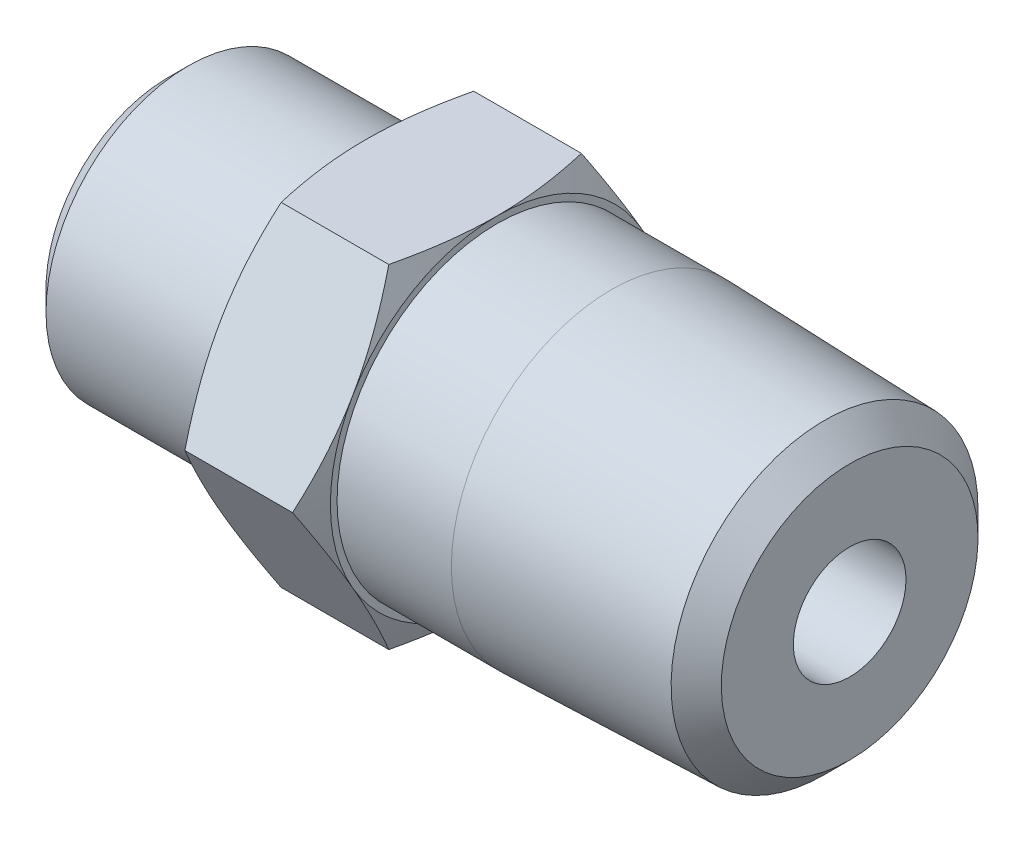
ISO-10303-21;
HEADER;
FILE_DESCRIPTION(('STEP AP214'),'2;1');
FILE_NAME('part.step','',(''),(''),'','','');
FILE_SCHEMA(('AUTOMOTIVE_DESIGN { 1 0 10303 214 1 1 1 1 }'));
ENDSEC;
DATA;
#1=APPLICATION_CONTEXT('core data for automotive mechanical design processes');
#2=APPLICATION_PROTOCOL_DEFINITION('international standard','automotive_design',2000,#1);
#3=PRODUCT_CONTEXT('',#1,'mechanical');
#4=PRODUCT('Part','Part','',(#3));
#5=PRODUCT_RELATED_PRODUCT_CATEGORY('part','',(#4));
#6=PRODUCT_DEFINITION_FORMATION('','',#4);
#7=PRODUCT_DEFINITION_CONTEXT('part definition',#1,'design');
#8=PRODUCT_DEFINITION('design','',#6,#7);
#9=PRODUCT_DEFINITION_SHAPE('','',#8);
#10=(LENGTH_UNIT() NAMED_UNIT(*) SI_UNIT(.MILLI.,.METRE.));
#11=(NAMED_UNIT(*) PLANE_ANGLE_UNIT() SI_UNIT($,.RADIAN.));
#12=(NAMED_UNIT(*) SI_UNIT($,.STERADIAN.) SOLID_ANGLE_UNIT());
#13=UNCERTAINTY_MEASURE_WITH_UNIT(LENGTH_MEASURE(1.E-05),#10,'distance_accuracy_value','');
#14=(GEOMETRIC_REPRESENTATION_CONTEXT(3) GLOBAL_UNCERTAINTY_ASSIGNED_CONTEXT((#13)) GLOBAL_UNIT_ASSIGNED_CONTEXT((#10,
#11,#12)) REPRESENTATION_CONTEXT('',''));
#15=CARTESIAN_POINT('',(0.,0.,0.));
#16=DIRECTION('',(0.,0.,1.));
#17=DIRECTION('',(1.,0.,0.));
#18=AXIS2_PLACEMENT_3D('',#15,#16,#17);
#19=CARTESIAN_POINT('',(0.876299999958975,0.,0.));
#20=DIRECTION('',(1.,0.,0.));
#21=DIRECTION('',(0.,0.,-1.));
#22=AXIS2_PLACEMENT_3D('',#19,#20,#21);
#23=CONICAL_SURFACE('',#22,6.0959999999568,0.785398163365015);
#24=CARTESIAN_POINT('',(0.8763,0.,0.));
#25=DIRECTION('',(1.,0.,0.));
#26=DIRECTION('',(0.,0.,-1.));
#27=AXIS2_PLACEMENT_3D('',#24,#25,#26);
#28=CIRCLE('',#27,6.096);
#29=CARTESIAN_POINT('',(0.876300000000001,0.,-6.096));
#30=VERTEX_POINT('',#29);
#31=EDGE_CURVE('E445',#30,#30,#28,.T.);
#32=ORIENTED_EDGE('',*,*,#31,.F.);
#33=EDGE_LOOP('',(#32));
#34=FACE_BOUND('',#33,.T.);
#35=CARTESIAN_POINT('',(-1.13686837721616E-10,0.,0.));
#36=DIRECTION('',(1.,0.,0.));
#37=DIRECTION('',(0.,0.,-1.));
#38=AXIS2_PLACEMENT_3D('',#35,#36,#37);
#39=CIRCLE('',#38,5.21969999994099);
#40=CARTESIAN_POINT('',(-1.13685955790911E-10,0.,-5.21969999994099));
#41=VERTEX_POINT('',#40);
#42=EDGE_CURVE('E20',#41,#41,#39,.F.);
#43=ORIENTED_EDGE('',*,*,#42,.F.);
#44=EDGE_LOOP('',(#43));
#45=FACE_BOUND('',#44,.T.);
#46=ADVANCED_FACE('F17',(#34,#45),#23,.T.);
#47=CARTESIAN_POINT('',(4.670298,0.,0.));
#48=DIRECTION('',(1.,0.,0.));
#49=DIRECTION('',(0.,0.,-1.));
#50=AXIS2_PLACEMENT_3D('',#47,#48,#49);
#51=CYLINDRICAL_SURFACE('',#50,6.096);
#52=CARTESIAN_POINT('',(8.464296,0.,0.));
#53=DIRECTION('',(1.,0.,0.));
#54=DIRECTION('',(0.,0.,-1.));
#55=AXIS2_PLACEMENT_3D('',#52,#53,#54);
#56=CIRCLE('',#55,6.096);
#57=CARTESIAN_POINT('',(8.464296,0.,-6.096));
#58=VERTEX_POINT('',#57);
#59=EDGE_CURVE('E516',#58,#58,#56,.T.);
#60=ORIENTED_EDGE('',*,*,#59,.F.);
#61=EDGE_LOOP('',(#60));
#62=FACE_BOUND('',#61,.T.);
#63=ORIENTED_EDGE('',*,*,#31,.T.);
#64=EDGE_LOOP('',(#63));
#65=FACE_BOUND('',#64,.T.);
#66=ADVANCED_FACE('F329',(#62,#65),#51,.T.);
#67=CARTESIAN_POINT('',(0.,0.,2.60985));
#68=DIRECTION('',(-1.,0.,0.));
#69=DIRECTION('',(0.,0.,1.));
#70=AXIS2_PLACEMENT_3D('',#67,#68,#69);
#71=PLANE('',#70);
#72=ORIENTED_EDGE('',*,*,#42,.T.);
#73=EDGE_LOOP('',(#72));
#74=FACE_BOUND('',#73,.T.);
#75=CARTESIAN_POINT('',(0.,0.,0.));
#76=DIRECTION('',(1.,0.,0.));
#77=DIRECTION('',(0.,0.,-1.));
#78=AXIS2_PLACEMENT_3D('',#75,#76,#77);
#79=CIRCLE('',#78,3.175);
#80=CARTESIAN_POINT('',(0.,0.,-3.175));
#81=VERTEX_POINT('',#80);
#82=EDGE_CURVE('E140',#81,#81,#79,.T.);
#83=ORIENTED_EDGE('',*,*,#82,.T.);
#84=EDGE_LOOP('',(#83));
#85=FACE_BOUND('',#84,.T.);
#86=ADVANCED_FACE('F327',(#74,#85),#71,.T.);
#87=CARTESIAN_POINT('',(8.464296,0.,3.571875));
#88=DIRECTION('',(-1.,0.,0.));
#89=DIRECTION('',(0.,0.,1.));
#90=AXIS2_PLACEMENT_3D('',#87,#88,#89);
#91=PLANE('',#90);
#92=CARTESIAN_POINT('',(8.464296,0.,0.));
#93=DIRECTION('',(1.,0.,0.));
#94=DIRECTION('',(0.,0.,-1.));
#95=AXIS2_PLACEMENT_3D('',#92,#93,#94);
#96=CIRCLE('',#95,7.14375);
#97=CARTESIAN_POINT('',(8.464296,-3.571875,6.18666897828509));
#98=VERTEX_POINT('',#97);
#99=CARTESIAN_POINT('',(8.464296,-7.14375,0.));
#100=VERTEX_POINT('',#99);
#101=EDGE_CURVE('E134',#98,#100,#96,.T.);
#102=ORIENTED_EDGE('',*,*,#101,.F.);
#103=CARTESIAN_POINT('',(8.464296,0.,0.));
#104=DIRECTION('',(1.,0.,0.));
#105=DIRECTION('',(0.,0.,-1.));
#106=AXIS2_PLACEMENT_3D('',#103,#104,#105);
#107=CIRCLE('',#106,7.14375);
#108=CARTESIAN_POINT('',(8.464296,3.57187500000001,6.18666897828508));
#109=VERTEX_POINT('',#108);
#110=EDGE_CURVE('E127',#109,#98,#107,.T.);
#111=ORIENTED_EDGE('',*,*,#110,.F.);
#112=CARTESIAN_POINT('',(8.464296,0.,0.));
#113=DIRECTION('',(1.,0.,0.));
#114=DIRECTION('',(0.,0.,-1.));
#115=AXIS2_PLACEMENT_3D('',#112,#113,#114);
#116=CIRCLE('',#115,7.14375);
#117=CARTESIAN_POINT('',(8.464296,7.14375,0.));
#118=VERTEX_POINT('',#117);
#119=EDGE_CURVE('E131',#118,#109,#116,.T.);
#120=ORIENTED_EDGE('',*,*,#119,.F.);
#121=CARTESIAN_POINT('',(8.464296,0.,0.));
#122=DIRECTION('',(1.,0.,0.));
#123=DIRECTION('',(0.,0.,-1.));
#124=AXIS2_PLACEMENT_3D('',#121,#122,#123);
#125=CIRCLE('',#124,7.14375);
#126=CARTESIAN_POINT('',(8.464296,3.571875,-6.18666897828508));
#127=VERTEX_POINT('',#126);
#128=EDGE_CURVE('E151',#127,#118,#125,.T.);
#129=ORIENTED_EDGE('',*,*,#128,.F.);
#130=CARTESIAN_POINT('',(8.464296,0.,0.));
#131=DIRECTION('',(1.,0.,0.));
#132=DIRECTION('',(0.,0.,-1.));
#133=AXIS2_PLACEMENT_3D('',#130,#131,#132);
#134=CIRCLE('',#133,7.14375);
#135=CARTESIAN_POINT('',(8.464296,-3.571875,-6.18666897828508));
#136=VERTEX_POINT('',#135);
#137=EDGE_CURVE('E152',#136,#127,#134,.T.);
#138=ORIENTED_EDGE('',*,*,#137,.F.);
#139=CARTESIAN_POINT('',(8.464296,0.,0.));
#140=DIRECTION('',(1.,0.,0.));
#141=DIRECTION('',(0.,0.,-1.));
#142=AXIS2_PLACEMENT_3D('',#139,#140,#141);
#143=CIRCLE('',#142,7.14375);
#144=EDGE_CURVE('E525',#100,#136,#143,.T.);
#145=ORIENTED_EDGE('',*,*,#144,.F.);
#146=EDGE_LOOP('',(#102,#111,#120,#129,#138,#145));
#147=FACE_BOUND('',#146,.T.);
#148=ORIENTED_EDGE('',*,*,#59,.T.);
#149=EDGE_LOOP('',(#148));
#150=FACE_BOUND('',#149,.T.);
#151=ADVANCED_FACE('F129',(#147,#150),#91,.T.);
#152=CARTESIAN_POINT('',(3.556,0.,0.));
#153=DIRECTION('',(1.,0.,0.));
#154=DIRECTION('',(0.,0.,-1.));
#155=AXIS2_PLACEMENT_3D('',#152,#153,#154);
#156=CYLINDRICAL_SURFACE('',#155,3.175);
#157=CARTESIAN_POINT('',(7.112,0.,0.));
#158=DIRECTION('',(1.,0.,0.));
#159=DIRECTION('',(0.,0.,-1.));
#160=AXIS2_PLACEMENT_3D('',#157,#158,#159);
#161=CIRCLE('',#160,3.175);
#162=CARTESIAN_POINT('',(7.112,0.,-3.175));
#163=VERTEX_POINT('',#162);
#164=EDGE_CURVE('E167',#163,#163,#161,.T.);
#165=ORIENTED_EDGE('',*,*,#164,.T.);
#166=EDGE_LOOP('',(#165));
#167=FACE_BOUND('',#166,.T.);
#168=ORIENTED_EDGE('',*,*,#82,.F.);
#169=EDGE_LOOP('',(#168));
#170=FACE_BOUND('',#169,.T.);
#171=ADVANCED_FACE('F320',(#167,#170),#156,.F.);
#172=CARTESIAN_POINT('',(8.98272418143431,0.,0.));
#173=DIRECTION('',(1.,0.,0.));
#174=DIRECTION('',(0.,0.,-1.));
#175=AXIS2_PLACEMENT_3D('',#172,#173,#174);
#176=CONICAL_SURFACE('',#175,8.25552282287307,1.13446401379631);
#177=ORIENTED_EDGE('',*,*,#110,.T.);
#178=CARTESIAN_POINT('',(8.97963216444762,0.,8.24889197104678));
#179=CARTESIAN_POINT('',(8.90070547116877,-0.293058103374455,8.07969479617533));
#180=CARTESIAN_POINT('',(8.82867608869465,-0.58769517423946,7.90958600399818));
#181=CARTESIAN_POINT('',(8.70188396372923,-1.17869518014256,7.56837199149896));
#182=CARTESIAN_POINT('',(8.64706399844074,-1.47504898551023,7.39727204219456));
#183=CARTESIAN_POINT('',(8.57993846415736,-1.92140845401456,7.13956628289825));
#184=CARTESIAN_POINT('',(8.5600754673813,-2.07056344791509,7.0534516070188));
#185=CARTESIAN_POINT('',(8.52573200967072,-2.36933901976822,6.88095345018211));
#186=CARTESIAN_POINT('',(8.51125147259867,-2.5189595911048,6.79456997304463));
#187=CARTESIAN_POINT('',(8.48791531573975,-2.81903318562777,6.6213224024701));
#188=CARTESIAN_POINT('',(8.47907862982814,-2.96948732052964,6.53445766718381));
#189=CARTESIAN_POINT('',(8.46725831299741,-3.27058454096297,6.36061910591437));
#190=CARTESIAN_POINT('',(8.46427535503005,-3.42122764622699,6.27364526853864));
#191=CARTESIAN_POINT('',(8.464296,-3.571875,6.18666897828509));
#192=B_SPLINE_CURVE_WITH_KNOTS('',3,(#178,#179,#180,#181,#182,#183,#184,#185,#186,#187,#188,
#189,#190,#191),.UNSPECIFIED.,.F.,.F.,(4,2,2,2,2,2,4),(0.,1.04269338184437,2.08188206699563,
2.60191814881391,3.12194687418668,3.6437111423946,4.1655353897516),.UNSPECIFIED.);
#193=CARTESIAN_POINT('',(8.97963216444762,0.,8.24889197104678));
#194=VERTEX_POINT('',#193);
#195=EDGE_CURVE('E157',#194,#98,#192,.T.);
#196=ORIENTED_EDGE('',*,*,#195,.F.);
#197=CARTESIAN_POINT('',(8.464296,3.57187500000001,6.18666897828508));
#198=CARTESIAN_POINT('',(8.46427535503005,3.421227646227,6.27364526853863));
#199=CARTESIAN_POINT('',(8.46725831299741,3.27058454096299,6.36061910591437));
#200=CARTESIAN_POINT('',(8.47907862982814,2.96948732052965,6.53445766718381));
#201=CARTESIAN_POINT('',(8.48791531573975,2.81903318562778,6.62132240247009));
#202=CARTESIAN_POINT('',(8.51125147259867,2.51895959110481,6.79456997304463));
#203=CARTESIAN_POINT('',(8.52573200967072,2.36933901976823,6.88095345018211));
#204=CARTESIAN_POINT('',(8.5600754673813,2.07056344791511,7.05345160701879));
#205=CARTESIAN_POINT('',(8.57993846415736,1.92140845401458,7.13956628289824));
#206=CARTESIAN_POINT('',(8.64706399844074,1.47504898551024,7.39727204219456));
#207=CARTESIAN_POINT('',(8.70188396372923,1.17869518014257,7.56837199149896));
#208=CARTESIAN_POINT('',(8.82867608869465,0.587695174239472,7.90958600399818));
#209=CARTESIAN_POINT('',(8.90070547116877,0.293058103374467,8.07969479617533));
#210=CARTESIAN_POINT('',(8.97963216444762,0.,8.24889197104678));
#211=B_SPLINE_CURVE_WITH_KNOTS('',3,(#197,#198,#199,#200,#201,#202,#203,#204,#205,#206,#207,
#208,#209,#210),.UNSPECIFIED.,.F.,.F.,(4,2,2,2,2,2,4),(0.,0.521824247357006,1.04358851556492,
1.56361724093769,2.08365332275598,3.12284200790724,4.16553538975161),.UNSPECIFIED.);
#212=EDGE_CURVE('E154',#109,#194,#211,.T.);
#213=ORIENTED_EDGE('',*,*,#212,.F.);
#214=EDGE_LOOP('',(#177,#196,#213));
#215=FACE_BOUND('',#214,.T.);
#216=ADVANCED_FACE('F155',(#215),#176,.T.);
#217=CARTESIAN_POINT('',(8.98272418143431,0.,0.));
#218=DIRECTION('',(1.,0.,0.));
#219=DIRECTION('',(0.,0.,-1.));
#220=AXIS2_PLACEMENT_3D('',#217,#218,#219);
#221=CONICAL_SURFACE('',#220,8.25552282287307,1.13446401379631);
#222=ORIENTED_EDGE('',*,*,#101,.T.);
#223=CARTESIAN_POINT('',(8.97963216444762,-7.14375,4.1244459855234));
#224=CARTESIAN_POINT('',(8.90070547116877,-7.14375,3.7860516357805));
#225=CARTESIAN_POINT('',(8.82867608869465,-7.14375,3.44583405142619));
#226=CARTESIAN_POINT('',(8.70188396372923,-7.14375,2.76340602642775));
#227=CARTESIAN_POINT('',(8.64706399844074,-7.14375,2.42120612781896));
#228=CARTESIAN_POINT('',(8.57993846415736,-7.14375,1.90579460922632));
#229=CARTESIAN_POINT('',(8.5600754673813,-7.14375,1.73356525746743));
#230=CARTESIAN_POINT('',(8.52573200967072,-7.14375,1.38856894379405));
#231=CARTESIAN_POINT('',(8.51125147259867,-7.14375,1.21580198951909));
#232=CARTESIAN_POINT('',(8.48791531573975,-7.14375,0.869306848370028));
#233=CARTESIAN_POINT('',(8.47907862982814,-7.14375,0.695577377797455));
#234=CARTESIAN_POINT('',(8.46725831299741,-7.14375,0.347900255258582));
#235=CARTESIAN_POINT('',(8.46427535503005,-7.14375,0.173952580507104));
#236=CARTESIAN_POINT('',(8.464296,-7.14375,0.));
#237=B_SPLINE_CURVE_WITH_KNOTS('',3,(#223,#224,#225,#226,#227,#228,#229,#230,#231,#232,#233,
#234,#235,#236),.UNSPECIFIED.,.F.,.F.,(4,2,2,2,2,2,4),(0.,1.04269338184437,2.08188206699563,
2.60191814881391,3.12194687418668,3.6437111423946,4.1655353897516),.UNSPECIFIED.);
#238=CARTESIAN_POINT('',(8.97963216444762,-7.14375,4.12444598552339));
#239=VERTEX_POINT('',#238);
#240=EDGE_CURVE('E302',#239,#100,#237,.T.);
#241=ORIENTED_EDGE('',*,*,#240,.F.);
#242=CARTESIAN_POINT('',(8.464296,-3.571875,6.18666897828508));
#243=CARTESIAN_POINT('',(8.46427535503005,-3.722522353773,6.09969268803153));
#244=CARTESIAN_POINT('',(8.46725831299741,-3.87316545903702,6.0127188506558));
#245=CARTESIAN_POINT('',(8.47907862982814,-4.17426267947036,5.83888028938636));
#246=CARTESIAN_POINT('',(8.48791531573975,-4.32471681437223,5.75201555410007));
#247=CARTESIAN_POINT('',(8.51125147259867,-4.62479040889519,5.57876798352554));
#248=CARTESIAN_POINT('',(8.52573200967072,-4.77441098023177,5.49238450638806));
#249=CARTESIAN_POINT('',(8.5600754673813,-5.0731865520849,5.31988634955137));
#250=CARTESIAN_POINT('',(8.57993846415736,-5.22234154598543,5.23377167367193));
#251=CARTESIAN_POINT('',(8.64706399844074,-5.66870101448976,4.97606591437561));
#252=CARTESIAN_POINT('',(8.70188396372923,-5.96505481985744,4.80496596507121));
#253=CARTESIAN_POINT('',(8.82867608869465,-6.55605482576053,4.46375195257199));
#254=CARTESIAN_POINT('',(8.90070547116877,-6.85069189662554,4.29364316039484));
#255=CARTESIAN_POINT('',(8.97963216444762,-7.14375,4.12444598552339));
#256=B_SPLINE_CURVE_WITH_KNOTS('',3,(#242,#243,#244,#245,#246,#247,#248,#249,#250,#251,#252,
#253,#254,#255),.UNSPECIFIED.,.F.,.F.,(4,2,2,2,2,2,4),(0.,0.521824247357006,1.04358851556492,
1.56361724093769,2.08365332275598,3.12284200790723,4.1655353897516),.UNSPECIFIED.);
#257=EDGE_CURVE('E294',#98,#239,#256,.T.);
#258=ORIENTED_EDGE('',*,*,#257,.F.);
#259=EDGE_LOOP('',(#222,#241,#258));
#260=FACE_BOUND('',#259,.T.);
#261=ADVANCED_FACE('F310',(#260),#221,.T.);
#262=CARTESIAN_POINT('',(8.98272418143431,0.,0.));
#263=DIRECTION('',(1.,0.,0.));
#264=DIRECTION('',(0.,0.,-1.));
#265=AXIS2_PLACEMENT_3D('',#262,#263,#264);
#266=CONICAL_SURFACE('',#265,8.25552282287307,1.13446401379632);
#267=ORIENTED_EDGE('',*,*,#144,.T.);
#268=CARTESIAN_POINT('',(8.97963216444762,-7.14375,-4.12444598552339));
#269=CARTESIAN_POINT('',(8.90070547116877,-6.85069189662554,-4.29364316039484));
#270=CARTESIAN_POINT('',(8.82867608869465,-6.55605482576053,-4.46375195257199));
#271=CARTESIAN_POINT('',(8.70188396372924,-5.96505481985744,-4.80496596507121));
#272=CARTESIAN_POINT('',(8.64706399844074,-5.66870101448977,-4.97606591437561));
#273=CARTESIAN_POINT('',(8.57993846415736,-5.22234154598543,-5.23377167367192));
#274=CARTESIAN_POINT('',(8.5600754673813,-5.0731865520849,-5.31988634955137));
#275=CARTESIAN_POINT('',(8.52573200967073,-4.77441098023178,-5.49238450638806));
#276=CARTESIAN_POINT('',(8.51125147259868,-4.62479040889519,-5.57876798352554));
#277=CARTESIAN_POINT('',(8.48791531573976,-4.32471681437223,-5.75201555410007));
#278=CARTESIAN_POINT('',(8.47907862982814,-4.17426267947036,-5.83888028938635));
#279=CARTESIAN_POINT('',(8.46725831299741,-3.87316545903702,-6.01271885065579));
#280=CARTESIAN_POINT('',(8.46427535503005,-3.72252235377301,-6.09969268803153));
#281=CARTESIAN_POINT('',(8.464296,-3.571875,-6.18666897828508));
#282=B_SPLINE_CURVE_WITH_KNOTS('',3,(#268,#269,#270,#271,#272,#273,#274,#275,#276,#277,#278,
#279,#280,#281),.UNSPECIFIED.,.F.,.F.,(4,2,2,2,2,2,4),(0.,1.04269338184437,2.08188206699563,
2.60191814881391,3.12194687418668,3.64371114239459,4.1655353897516),.UNSPECIFIED.);
#283=CARTESIAN_POINT('',(8.97963216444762,-7.14375,-4.12444598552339));
#284=VERTEX_POINT('',#283);
#285=EDGE_CURVE('E410',#284,#136,#282,.T.);
#286=ORIENTED_EDGE('',*,*,#285,.F.);
#287=CARTESIAN_POINT('',(8.464296,-7.14375,0.));
#288=CARTESIAN_POINT('',(8.46427535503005,-7.14375,-0.173952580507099));
#289=CARTESIAN_POINT('',(8.46725831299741,-7.14375,-0.347900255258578));
#290=CARTESIAN_POINT('',(8.47907862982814,-7.14375,-0.695577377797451));
#291=CARTESIAN_POINT('',(8.48791531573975,-7.14375,-0.869306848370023));
#292=CARTESIAN_POINT('',(8.51125147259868,-7.14375,-1.21580198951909));
#293=CARTESIAN_POINT('',(8.52573200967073,-7.14375,-1.38856894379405));
#294=CARTESIAN_POINT('',(8.5600754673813,-7.14375,-1.73356525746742));
#295=CARTESIAN_POINT('',(8.57993846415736,-7.14375,-1.90579460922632));
#296=CARTESIAN_POINT('',(8.64706399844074,-7.14375,-2.42120612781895));
#297=CARTESIAN_POINT('',(8.70188396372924,-7.14375,-2.76340602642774));
#298=CARTESIAN_POINT('',(8.82867608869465,-7.14375,-3.44583405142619));
#299=CARTESIAN_POINT('',(8.90070547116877,-7.14375,-3.78605163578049));
#300=CARTESIAN_POINT('',(8.97963216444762,-7.14375,-4.12444598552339));
#301=B_SPLINE_CURVE_WITH_KNOTS('',3,(#287,#288,#289,#290,#291,#292,#293,#294,#295,#296,#297,
#298,#299,#300),.UNSPECIFIED.,.F.,.F.,(4,2,2,2,2,2,4),(0.,0.521824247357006,1.04358851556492,
1.56361724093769,2.08365332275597,3.12284200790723,4.1655353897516),.UNSPECIFIED.);
#302=EDGE_CURVE('E421',#100,#284,#301,.T.);
#303=ORIENTED_EDGE('',*,*,#302,.F.);
#304=EDGE_LOOP('',(#267,#286,#303));
#305=FACE_BOUND('',#304,.T.);
#306=ADVANCED_FACE('F313',(#305),#266,.T.);
#307=CARTESIAN_POINT('',(8.98272418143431,0.,0.));
#308=DIRECTION('',(1.,0.,0.));
#309=DIRECTION('',(0.,0.,-1.));
#310=AXIS2_PLACEMENT_3D('',#307,#308,#309);
#311=CONICAL_SURFACE('',#310,8.25552282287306,1.13446401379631);
#312=ORIENTED_EDGE('',*,*,#137,.T.);
#313=CARTESIAN_POINT('',(8.97963216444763,0.,-8.24889197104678));
#314=CARTESIAN_POINT('',(8.90070547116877,0.293058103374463,-8.07969479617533));
#315=CARTESIAN_POINT('',(8.82867608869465,0.587695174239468,-7.90958600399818));
#316=CARTESIAN_POINT('',(8.70188396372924,1.17869518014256,-7.56837199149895));
#317=CARTESIAN_POINT('',(8.64706399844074,1.47504898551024,-7.39727204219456));
#318=CARTESIAN_POINT('',(8.57993846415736,1.92140845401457,-7.13956628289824));
#319=CARTESIAN_POINT('',(8.5600754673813,2.0705634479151,-7.05345160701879));
#320=CARTESIAN_POINT('',(8.52573200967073,2.36933901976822,-6.88095345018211));
#321=CARTESIAN_POINT('',(8.51125147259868,2.51895959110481,-6.79456997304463));
#322=CARTESIAN_POINT('',(8.48791531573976,2.81903318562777,-6.6213224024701));
#323=CARTESIAN_POINT('',(8.47907862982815,2.96948732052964,-6.53445766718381));
#324=CARTESIAN_POINT('',(8.46725831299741,3.27058454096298,-6.36061910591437));
#325=CARTESIAN_POINT('',(8.46427535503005,3.42122764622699,-6.27364526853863));
#326=CARTESIAN_POINT('',(8.464296,3.571875,-6.18666897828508));
#327=B_SPLINE_CURVE_WITH_KNOTS('',3,(#313,#314,#315,#316,#317,#318,#319,#320,#321,#322,#323,
#324,#325,#326),.UNSPECIFIED.,.F.,.F.,(4,2,2,2,2,2,4),(0.,1.04269338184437,2.08188206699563,
2.60191814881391,3.12194687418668,3.64371114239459,4.1655353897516),.UNSPECIFIED.);
#328=CARTESIAN_POINT('',(8.97963216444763,0.,-8.24889197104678));
#329=VERTEX_POINT('',#328);
#330=EDGE_CURVE('E411',#329,#127,#327,.T.);
#331=ORIENTED_EDGE('',*,*,#330,.F.);
#332=CARTESIAN_POINT('',(8.464296,-3.571875,-6.18666897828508));
#333=CARTESIAN_POINT('',(8.46427535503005,-3.421227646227,-6.27364526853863));
#334=CARTESIAN_POINT('',(8.46725831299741,-3.27058454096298,-6.36061910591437));
#335=CARTESIAN_POINT('',(8.47907862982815,-2.96948732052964,-6.53445766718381));
#336=CARTESIAN_POINT('',(8.48791531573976,-2.81903318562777,-6.62132240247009));
#337=CARTESIAN_POINT('',(8.51125147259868,-2.51895959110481,-6.79456997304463));
#338=CARTESIAN_POINT('',(8.52573200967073,-2.36933901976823,-6.88095345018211));
#339=CARTESIAN_POINT('',(8.5600754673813,-2.0705634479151,-7.05345160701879));
#340=CARTESIAN_POINT('',(8.57993846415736,-1.92140845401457,-7.13956628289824));
#341=CARTESIAN_POINT('',(8.64706399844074,-1.47504898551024,-7.39727204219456));
#342=CARTESIAN_POINT('',(8.70188396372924,-1.17869518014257,-7.56837199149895));
#343=CARTESIAN_POINT('',(8.82867608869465,-0.587695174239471,-7.90958600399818));
#344=CARTESIAN_POINT('',(8.90070547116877,-0.293058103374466,-8.07969479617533));
#345=CARTESIAN_POINT('',(8.97963216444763,0.,-8.24889197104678));
#346=B_SPLINE_CURVE_WITH_KNOTS('',3,(#332,#333,#334,#335,#336,#337,#338,#339,#340,#341,#342,
#343,#344,#345),.UNSPECIFIED.,.F.,.F.,(4,2,2,2,2,2,4),(0.,0.521824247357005,1.04358851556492,
1.56361724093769,2.08365332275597,3.12284200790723,4.1655353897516),.UNSPECIFIED.);
#347=EDGE_CURVE('E404',#136,#329,#346,.T.);
#348=ORIENTED_EDGE('',*,*,#347,.F.);
#349=EDGE_LOOP('',(#312,#331,#348));
#350=FACE_BOUND('',#349,.T.);
#351=ADVANCED_FACE('F193',(#350),#311,.T.);
#352=CARTESIAN_POINT('',(8.98272418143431,0.,0.));
#353=DIRECTION('',(1.,0.,0.));
#354=DIRECTION('',(0.,0.,-1.));
#355=AXIS2_PLACEMENT_3D('',#352,#353,#354);
#356=CONICAL_SURFACE('',#355,8.25552282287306,1.13446401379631);
#357=CARTESIAN_POINT('',(8.464296,7.14375,0.));
#358=CARTESIAN_POINT('',(8.46427535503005,7.14375,0.1739525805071));
#359=CARTESIAN_POINT('',(8.46725831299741,7.14375,0.347900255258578));
#360=CARTESIAN_POINT('',(8.47907862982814,7.14375,0.69557737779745));
#361=CARTESIAN_POINT('',(8.48791531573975,7.14375,0.869306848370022));
#362=CARTESIAN_POINT('',(8.51125147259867,7.14375,1.21580198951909));
#363=CARTESIAN_POINT('',(8.52573200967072,7.14375,1.38856894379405));
#364=CARTESIAN_POINT('',(8.5600754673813,7.14375,1.73356525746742));
#365=CARTESIAN_POINT('',(8.57993846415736,7.14375,1.90579460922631));
#366=CARTESIAN_POINT('',(8.64706399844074,7.14375,2.42120612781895));
#367=CARTESIAN_POINT('',(8.70188396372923,7.14375,2.76340602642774));
#368=CARTESIAN_POINT('',(8.82867608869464,7.14375,3.44583405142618));
#369=CARTESIAN_POINT('',(8.90070547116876,7.14375,3.78605163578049));
#370=CARTESIAN_POINT('',(8.97963216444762,7.14375,4.12444598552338));
#371=B_SPLINE_CURVE_WITH_KNOTS('',3,(#357,#358,#359,#360,#361,#362,#363,#364,#365,#366,#367,
#368,#369,#370),.UNSPECIFIED.,.F.,.F.,(4,2,2,2,2,2,4),(0.,0.521824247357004,1.04358851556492,
1.56361724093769,2.08365332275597,3.12284200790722,4.16553538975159),.UNSPECIFIED.);
#372=CARTESIAN_POINT('',(8.97963216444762,7.14375,4.12444598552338));
#373=VERTEX_POINT('',#372);
#374=EDGE_CURVE('E148',#118,#373,#371,.T.);
#375=ORIENTED_EDGE('',*,*,#374,.F.);
#376=ORIENTED_EDGE('',*,*,#119,.T.);
#377=CARTESIAN_POINT('',(8.97963216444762,7.14375000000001,4.12444598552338));
#378=CARTESIAN_POINT('',(8.90070547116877,6.85069189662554,4.29364316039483));
#379=CARTESIAN_POINT('',(8.82867608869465,6.55605482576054,4.46375195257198));
#380=CARTESIAN_POINT('',(8.70188396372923,5.96505481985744,4.80496596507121));
#381=CARTESIAN_POINT('',(8.64706399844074,5.66870101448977,4.9760659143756));
#382=CARTESIAN_POINT('',(8.57993846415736,5.22234154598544,5.23377167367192));
#383=CARTESIAN_POINT('',(8.5600754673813,5.07318655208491,5.31988634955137));
#384=CARTESIAN_POINT('',(8.52573200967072,4.77441098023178,5.49238450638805));
#385=CARTESIAN_POINT('',(8.51125147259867,4.6247904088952,5.57876798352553));
#386=CARTESIAN_POINT('',(8.48791531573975,4.32471681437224,5.75201555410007));
#387=CARTESIAN_POINT('',(8.47907862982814,4.17426267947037,5.83888028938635));
#388=CARTESIAN_POINT('',(8.46725831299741,3.87316545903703,6.01271885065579));
#389=CARTESIAN_POINT('',(8.46427535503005,3.72252235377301,6.09969268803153));
#390=CARTESIAN_POINT('',(8.464296,3.57187500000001,6.18666897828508));
#391=B_SPLINE_CURVE_WITH_KNOTS('',3,(#377,#378,#379,#380,#381,#382,#383,#384,#385,#386,#387,
#388,#389,#390),.UNSPECIFIED.,.F.,.F.,(4,2,2,2,2,2,4),(0.,1.04269338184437,2.08188206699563,
2.60191814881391,3.12194687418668,3.64371114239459,4.1655353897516),.UNSPECIFIED.);
#392=EDGE_CURVE('E145',#373,#109,#391,.T.);
#393=ORIENTED_EDGE('',*,*,#392,.F.);
#394=EDGE_LOOP('',(#375,#376,#393));
#395=FACE_BOUND('',#394,.T.);
#396=ADVANCED_FACE('F143',(#395),#356,.T.);
#397=CARTESIAN_POINT('',(8.98272418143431,0.,0.));
#398=DIRECTION('',(1.,0.,0.));
#399=DIRECTION('',(0.,0.,-1.));
#400=AXIS2_PLACEMENT_3D('',#397,#398,#399);
#401=CONICAL_SURFACE('',#400,8.25552282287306,1.13446401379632);
#402=ORIENTED_EDGE('',*,*,#128,.T.);
#403=CARTESIAN_POINT('',(8.97963216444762,7.14375,-4.12444598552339));
#404=CARTESIAN_POINT('',(8.90070547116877,7.14375,-3.78605163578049));
#405=CARTESIAN_POINT('',(8.82867608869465,7.14375,-3.44583405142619));
#406=CARTESIAN_POINT('',(8.70188396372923,7.14375,-2.76340602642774));
#407=CARTESIAN_POINT('',(8.64706399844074,7.14375,-2.42120612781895));
#408=CARTESIAN_POINT('',(8.57993846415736,7.14375,-1.90579460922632));
#409=CARTESIAN_POINT('',(8.5600754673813,7.14375,-1.73356525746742));
#410=CARTESIAN_POINT('',(8.52573200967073,7.14375,-1.38856894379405));
#411=CARTESIAN_POINT('',(8.51125147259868,7.14375,-1.21580198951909));
#412=CARTESIAN_POINT('',(8.48791531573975,7.14375,-0.869306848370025));
#413=CARTESIAN_POINT('',(8.47907862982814,7.14375,-0.695577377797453));
#414=CARTESIAN_POINT('',(8.46725831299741,7.14375,-0.34790025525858));
#415=CARTESIAN_POINT('',(8.46427535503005,7.14375,-0.173952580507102));
#416=CARTESIAN_POINT('',(8.464296,7.14375,0.));
#417=B_SPLINE_CURVE_WITH_KNOTS('',3,(#403,#404,#405,#406,#407,#408,#409,#410,#411,#412,#413,
#414,#415,#416),.UNSPECIFIED.,.F.,.F.,(4,2,2,2,2,2,4),(0.,1.04269338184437,2.08188206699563,
2.60191814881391,3.12194687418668,3.64371114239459,4.1655353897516),.UNSPECIFIED.);
#418=CARTESIAN_POINT('',(8.97963216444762,7.14375,-4.12444598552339));
#419=VERTEX_POINT('',#418);
#420=EDGE_CURVE('E207',#419,#118,#417,.T.);
#421=ORIENTED_EDGE('',*,*,#420,.F.);
#422=CARTESIAN_POINT('',(8.464296,3.571875,-6.18666897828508));
#423=CARTESIAN_POINT('',(8.46427535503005,3.72252235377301,-6.09969268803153));
#424=CARTESIAN_POINT('',(8.46725831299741,3.87316545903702,-6.0127188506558));
#425=CARTESIAN_POINT('',(8.47907862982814,4.17426267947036,-5.83888028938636));
#426=CARTESIAN_POINT('',(8.48791531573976,4.32471681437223,-5.75201555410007));
#427=CARTESIAN_POINT('',(8.51125147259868,4.62479040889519,-5.57876798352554));
#428=CARTESIAN_POINT('',(8.52573200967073,4.77441098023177,-5.49238450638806));
#429=CARTESIAN_POINT('',(8.5600754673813,5.0731865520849,-5.31988634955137));
#430=CARTESIAN_POINT('',(8.57993846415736,5.22234154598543,-5.23377167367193));
#431=CARTESIAN_POINT('',(8.64706399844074,5.66870101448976,-4.97606591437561));
#432=CARTESIAN_POINT('',(8.70188396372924,5.96505481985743,-4.80496596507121));
#433=CARTESIAN_POINT('',(8.82867608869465,6.55605482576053,-4.46375195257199));
#434=CARTESIAN_POINT('',(8.90070547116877,6.85069189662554,-4.29364316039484));
#435=CARTESIAN_POINT('',(8.97963216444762,7.14375,-4.12444598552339));
#436=B_SPLINE_CURVE_WITH_KNOTS('',3,(#422,#423,#424,#425,#426,#427,#428,#429,#430,#431,#432,
#433,#434,#435),.UNSPECIFIED.,.F.,.F.,(4,2,2,2,2,2,4),(0.,0.521824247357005,1.04358851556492,
1.56361724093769,2.08365332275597,3.12284200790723,4.1655353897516),.UNSPECIFIED.);
#437=EDGE_CURVE('E206',#127,#419,#436,.T.);
#438=ORIENTED_EDGE('',*,*,#437,.F.);
#439=EDGE_LOOP('',(#402,#421,#438));
#440=FACE_BOUND('',#439,.T.);
#441=ADVANCED_FACE('F192',(#440),#401,.T.);
#442=CARTESIAN_POINT('',(7.112,0.,0.));
#443=DIRECTION('',(1.,0.,0.));
#444=DIRECTION('',(0.,1.,0.));
#445=AXIS2_PLACEMENT_3D('',#442,#443,#444);
#446=PLANE('',#445);
#447=ORIENTED_EDGE('',*,*,#164,.F.);
#448=EDGE_LOOP('',(#447));
#449=FACE_BOUND('',#448,.T.);
#450=CARTESIAN_POINT('',(7.112,0.,0.));
#451=DIRECTION('',(1.,0.,0.));
#452=DIRECTION('',(0.,0.,-1.));
#453=AXIS2_PLACEMENT_3D('',#450,#451,#452);
#454=CIRCLE('',#453,2.413);
#455=CARTESIAN_POINT('',(7.112,0.,-2.413));
#456=VERTEX_POINT('',#455);
#457=EDGE_CURVE('E536',#456,#456,#454,.T.);
#458=ORIENTED_EDGE('',*,*,#457,.T.);
#459=EDGE_LOOP('',(#458));
#460=FACE_BOUND('',#459,.T.);
#461=ADVANCED_FACE('F620',(#449,#460),#446,.F.);
#462=CARTESIAN_POINT('',(11.285728,3.57187500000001,6.18666897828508));
#463=DIRECTION('',(0.,0.500000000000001,0.866025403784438));
#464=DIRECTION('',(0.,-0.866025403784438,0.500000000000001));
#465=AXIS2_PLACEMENT_3D('',#462,#463,#464);
#466=PLANE('',#465);
#467=DIRECTION('',(1.,0.,0.));
#468=VECTOR('',#467,1.);
#469=CARTESIAN_POINT('',(11.285728,0.,8.24889197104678));
#470=LINE('',#469,#468);
#471=CARTESIAN_POINT('',(13.5918238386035,-1.13330236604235E-08,8.24889196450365));
#472=VERTEX_POINT('',#471);
#473=EDGE_CURVE('E161',#472,#194,#470,.F.);
#474=ORIENTED_EDGE('',*,*,#473,.F.);
#475=CARTESIAN_POINT('',(14.10716,3.57187500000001,6.18666897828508));
#476=CARTESIAN_POINT('',(14.1071806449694,3.42122764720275,6.27364526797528));
#477=CARTESIAN_POINT('',(14.1041976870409,3.27058454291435,6.36061910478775));
#478=CARTESIAN_POINT('',(14.0923773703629,2.96948732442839,6.53445766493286));
#479=CARTESIAN_POINT('',(14.0835406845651,2.81903319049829,6.6213223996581));
#480=CARTESIAN_POINT('',(14.0602045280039,2.51895959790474,6.79456996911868));
#481=CARTESIAN_POINT('',(14.0457239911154,2.36933902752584,6.88095344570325));
#482=CARTESIAN_POINT('',(14.0113805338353,2.07056345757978,7.05345160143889));
#483=CARTESIAN_POINT('',(13.9915175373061,1.92140846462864,7.13956627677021));
#484=CARTESIAN_POINT('',(13.9243920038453,1.47504899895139,7.39727203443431));
#485=CARTESIAN_POINT('',(13.8695720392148,1.17869519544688,7.568371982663));
#486=CARTESIAN_POINT('',(13.742779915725,0.587695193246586,7.90958599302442));
#487=CARTESIAN_POINT('',(13.6707505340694,0.293058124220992,8.07969478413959));
#488=CARTESIAN_POINT('',(13.5918238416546,2.26660547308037E-08,8.24889195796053));
#489=B_SPLINE_CURVE_WITH_KNOTS('',3,(#475,#476,#477,#478,#479,#480,#481,#482,#483,#484,#485,
#486,#487,#488),.UNSPECIFIED.,.F.,.F.,(4,2,2,2,2,2,4),(0.,0.521824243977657,1.04358850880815,
1.5636172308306,2.08365330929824,3.12284198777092,4.16553536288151),.UNSPECIFIED.);
#490=CARTESIAN_POINT('',(14.10716,3.57187500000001,6.18666897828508));
#491=VERTEX_POINT('',#490);
#492=EDGE_CURVE('E247',#491,#472,#489,.T.);
#493=ORIENTED_EDGE('',*,*,#492,.F.);
#494=CARTESIAN_POINT('',(13.591823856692,7.14374992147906,4.12444603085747));
#495=CARTESIAN_POINT('',(13.6707505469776,6.8506918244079,4.29364320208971));
#496=CARTESIAN_POINT('',(13.742779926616,6.55605475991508,4.46375199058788));
#497=CARTESIAN_POINT('',(13.8695720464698,5.96505476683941,4.80496599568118));
#498=CARTESIAN_POINT('',(13.9243920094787,5.66870096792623,4.97606594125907));
#499=CARTESIAN_POINT('',(13.9915175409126,5.22234150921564,5.23377169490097));
#500=CARTESIAN_POINT('',(14.0113805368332,5.07318651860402,5.31988636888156));
#501=CARTESIAN_POINT('',(14.0457239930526,4.77441095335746,5.49238452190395));
#502=CARTESIAN_POINT('',(14.0602045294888,4.62479038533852,5.57876799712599));
#503=CARTESIAN_POINT('',(14.0835406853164,4.32471679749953,5.75201556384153));
#504=CARTESIAN_POINT('',(14.0923773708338,4.17426266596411,5.8388802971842));
#505=CARTESIAN_POINT('',(14.1041976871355,3.873165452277,6.01271885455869));
#506=CARTESIAN_POINT('',(14.1071806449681,3.72252235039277,6.09969268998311));
#507=CARTESIAN_POINT('',(14.10716,3.57187500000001,6.18666897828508));
#508=B_SPLINE_CURVE_WITH_KNOTS('',3,(#494,#495,#496,#497,#498,#499,#500,#501,#502,#503,#504,
#505,#506,#507),.UNSPECIFIED.,.F.,.F.,(4,2,2,2,2,2,4),(0.,1.04269335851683,2.0818820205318,
2.60191809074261,3.12194680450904,3.6437110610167,4.16553529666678),.UNSPECIFIED.);
#509=CARTESIAN_POINT('',(13.5918238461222,7.14374996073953,4.12444600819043));
#510=VERTEX_POINT('',#509);
#511=EDGE_CURVE('E248',#510,#491,#508,.T.);
#512=ORIENTED_EDGE('',*,*,#511,.F.);
#513=DIRECTION('',(1.,0.,0.));
#514=VECTOR('',#513,1.);
#515=CARTESIAN_POINT('',(11.285728,7.14375,4.12444598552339));
#516=LINE('',#515,#514);
#517=EDGE_CURVE('E165',#373,#510,#516,.T.);
#518=ORIENTED_EDGE('',*,*,#517,.F.);
#519=ORIENTED_EDGE('',*,*,#392,.T.);
#520=ORIENTED_EDGE('',*,*,#212,.T.);
#521=EDGE_LOOP('',(#474,#493,#512,#518,#519,#520));
#522=FACE_BOUND('',#521,.T.);
#523=ADVANCED_FACE('F163',(#522),#466,.T.);
#524=CARTESIAN_POINT('',(11.285728,-3.571875,6.18666897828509));
#525=DIRECTION('',(0.,-0.5,0.866025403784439));
#526=DIRECTION('',(0.,-0.866025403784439,-0.5));
#527=AXIS2_PLACEMENT_3D('',#524,#525,#526);
#528=PLANE('',#527);
#529=ORIENTED_EDGE('',*,*,#195,.T.);
#530=ORIENTED_EDGE('',*,*,#257,.T.);
#531=DIRECTION('',(1.,0.,0.));
#532=VECTOR('',#531,1.);
#533=CARTESIAN_POINT('',(11.285728,-7.14375,4.12444598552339));
#534=LINE('',#533,#532);
#535=CARTESIAN_POINT('',(13.5918238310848,-7.14375,4.12444600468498));
#536=VERTEX_POINT('',#535);
#537=EDGE_CURVE('E301',#536,#239,#534,.F.);
#538=ORIENTED_EDGE('',*,*,#537,.F.);
#539=CARTESIAN_POINT('',(14.10716,-3.571875,6.18666897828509));
#540=CARTESIAN_POINT('',(14.1071806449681,-3.72252235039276,6.09969268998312));
#541=CARTESIAN_POINT('',(14.1041976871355,-3.87316545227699,6.0127188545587));
#542=CARTESIAN_POINT('',(14.0923773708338,-4.1742626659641,5.8388802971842));
#543=CARTESIAN_POINT('',(14.0835406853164,-4.32471679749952,5.75201556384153));
#544=CARTESIAN_POINT('',(14.0602045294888,-4.62479038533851,5.578767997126));
#545=CARTESIAN_POINT('',(14.0457239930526,-4.77441095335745,5.49238452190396));
#546=CARTESIAN_POINT('',(14.0113805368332,-5.07318651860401,5.31988636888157));
#547=CARTESIAN_POINT('',(13.9915175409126,-5.22234150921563,5.23377169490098));
#548=CARTESIAN_POINT('',(13.9243920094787,-5.66870096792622,4.97606594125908));
#549=CARTESIAN_POINT('',(13.8695720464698,-5.9650547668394,4.80496599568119));
#550=CARTESIAN_POINT('',(13.742779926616,-6.55605475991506,4.46375199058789));
#551=CARTESIAN_POINT('',(13.6707505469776,-6.85069182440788,4.29364320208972));
#552=CARTESIAN_POINT('',(13.591823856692,-7.14374992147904,4.12444603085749));
#553=B_SPLINE_CURVE_WITH_KNOTS('',3,(#539,#540,#541,#542,#543,#544,#545,#546,#547,#548,#549,
#550,#551,#552),.UNSPECIFIED.,.F.,.F.,(4,2,2,2,2,2,4),(0.,0.521824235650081,1.04358849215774,
1.56361720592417,2.08365327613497,3.12284193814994,4.16553529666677),.UNSPECIFIED.);
#554=CARTESIAN_POINT('',(14.10716,-3.571875,6.18666897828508));
#555=VERTEX_POINT('',#554);
#556=EDGE_CURVE('E278',#555,#536,#553,.T.);
#557=ORIENTED_EDGE('',*,*,#556,.F.);
#558=CARTESIAN_POINT('',(13.5918238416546,-2.26660476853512E-08,8.24889195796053));
#559=CARTESIAN_POINT('',(13.6707505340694,-0.293058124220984,8.07969478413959));
#560=CARTESIAN_POINT('',(13.742779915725,-0.587695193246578,7.90958599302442));
#561=CARTESIAN_POINT('',(13.8695720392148,-1.17869519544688,7.56837198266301));
#562=CARTESIAN_POINT('',(13.9243920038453,-1.47504899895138,7.39727203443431));
#563=CARTESIAN_POINT('',(13.9915175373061,-1.92140846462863,7.13956627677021));
#564=CARTESIAN_POINT('',(14.0113805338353,-2.07056345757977,7.05345160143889));
#565=CARTESIAN_POINT('',(14.0457239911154,-2.36933902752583,6.88095344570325));
#566=CARTESIAN_POINT('',(14.0602045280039,-2.51895959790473,6.79456996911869));
#567=CARTESIAN_POINT('',(14.0835406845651,-2.81903319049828,6.6213223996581));
#568=CARTESIAN_POINT('',(14.0923773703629,-2.96948732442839,6.53445766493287));
#569=CARTESIAN_POINT('',(14.1041976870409,-3.27058454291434,6.36061910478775));
#570=CARTESIAN_POINT('',(14.1071806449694,-3.42122764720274,6.27364526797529));
#571=CARTESIAN_POINT('',(14.10716,-3.571875,6.18666897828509));
#572=B_SPLINE_CURVE_WITH_KNOTS('',3,(#558,#559,#560,#561,#562,#563,#564,#565,#566,#567,#568,
#569,#570,#571),.UNSPECIFIED.,.F.,.F.,(4,2,2,2,2,2,4),(0.,1.04269337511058,2.08188205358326,
2.6019181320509,3.12194685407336,3.64371111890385,4.1655353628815),.UNSPECIFIED.);
#573=EDGE_CURVE('E271',#472,#555,#572,.T.);
#574=ORIENTED_EDGE('',*,*,#573,.F.);
#575=ORIENTED_EDGE('',*,*,#473,.T.);
#576=EDGE_LOOP('',(#529,#530,#538,#557,#574,#575));
#577=FACE_BOUND('',#576,.T.);
#578=ADVANCED_FACE('F283',(#577),#528,.T.);
#579=CARTESIAN_POINT('',(11.285728,-7.14375,0.));
#580=DIRECTION('',(0.,-1.,0.));
#581=DIRECTION('',(0.,0.,-1.));
#582=AXIS2_PLACEMENT_3D('',#579,#580,#581);
#583=PLANE('',#582);
#584=DIRECTION('',(1.,0.,0.));
#585=VECTOR('',#584,1.);
#586=CARTESIAN_POINT('',(11.285728,-7.14375,-4.12444598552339));
#587=LINE('',#586,#585);
#588=CARTESIAN_POINT('',(13.5918238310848,-7.14375001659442,-4.12444597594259));
#589=VERTEX_POINT('',#588);
#590=EDGE_CURVE('E420',#589,#284,#587,.F.);
#591=ORIENTED_EDGE('',*,*,#590,.F.);
#592=CARTESIAN_POINT('',(14.10716,-7.14375,0.));
#593=CARTESIAN_POINT('',(14.1071806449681,-7.14375,-0.173952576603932));
#594=CARTESIAN_POINT('',(14.1041976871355,-7.14375,-0.347900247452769));
#595=CARTESIAN_POINT('',(14.0923773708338,-7.14375,-0.695577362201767));
#596=CARTESIAN_POINT('',(14.0835406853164,-7.14375,-0.869306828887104));
#597=CARTESIAN_POINT('',(14.0602045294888,-7.14375,-1.21580196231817));
#598=CARTESIAN_POINT('',(14.0457239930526,-7.14375,-1.38856891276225));
#599=CARTESIAN_POINT('',(14.0113805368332,-7.14375,-1.73356521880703));
#600=CARTESIAN_POINT('',(13.9915175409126,-7.14375,-1.90579456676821));
#601=CARTESIAN_POINT('',(13.9243920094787,-7.14375,-2.42120607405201));
#602=CARTESIAN_POINT('',(13.8695720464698,-7.14375,-2.76340596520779));
#603=CARTESIAN_POINT('',(13.742779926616,-7.14375,-3.4458339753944));
#604=CARTESIAN_POINT('',(13.6707505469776,-7.14375,-3.78605155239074));
#605=CARTESIAN_POINT('',(13.591823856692,-7.14375,-4.1244458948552));
#606=B_SPLINE_CURVE_WITH_KNOTS('',3,(#592,#593,#594,#595,#596,#597,#598,#599,#600,#601,#602,
#603,#604,#605),.UNSPECIFIED.,.F.,.F.,(4,2,2,2,2,2,4),(0.,0.521824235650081,1.04358849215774,
1.56361720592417,2.08365327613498,3.12284193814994,4.16553529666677),.UNSPECIFIED.);
#607=CARTESIAN_POINT('',(14.10716,-7.14375,0.));
#608=VERTEX_POINT('',#607);
#609=EDGE_CURVE('E552',#608,#589,#606,.T.);
#610=ORIENTED_EDGE('',*,*,#609,.F.);
#611=CARTESIAN_POINT('',(13.5918238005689,-7.14374996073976,4.12444601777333));
#612=CARTESIAN_POINT('',(13.6707505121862,-7.14374998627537,3.78605166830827));
#613=CARTESIAN_POINT('',(13.7427799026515,-7.14374999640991,3.44583408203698));
#614=CARTESIAN_POINT('',(13.8695720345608,-7.14375000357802,2.76340605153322));
#615=CARTESIAN_POINT('',(13.9243919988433,-7.14375000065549,2.42120614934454));
#616=CARTESIAN_POINT('',(13.9915175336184,-7.14374999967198,1.90579462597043));
#617=CARTESIAN_POINT('',(14.0113805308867,-7.14374999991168,1.73356527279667));
#618=CARTESIAN_POINT('',(14.0457239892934,-7.14375000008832,1.38856895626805));
#619=CARTESIAN_POINT('',(14.0602045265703,-7.14375000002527,1.21580200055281));
#620=CARTESIAN_POINT('',(14.0835406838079,-7.14374999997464,0.869306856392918));
#621=CARTESIAN_POINT('',(14.0923773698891,-7.14374999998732,0.695577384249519));
#622=CARTESIAN_POINT('',(14.1041976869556,-7.14375000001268,0.347900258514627));
#623=CARTESIAN_POINT('',(14.1071806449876,-7.14375000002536,0.1739525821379));
#624=CARTESIAN_POINT('',(14.10716,-7.14375,0.));
#625=B_SPLINE_CURVE_WITH_KNOTS('',3,(#611,#612,#613,#614,#615,#616,#617,#618,#619,#620,#621,
#622,#623,#624),.UNSPECIFIED.,.F.,.F.,(4,2,2,2,2,2,4),(0.,1.04269339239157,2.08188208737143,
2.60191817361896,3.1219469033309,3.64371117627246,4.16553542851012),.UNSPECIFIED.);
#626=EDGE_CURVE('E551',#536,#608,#625,.T.);
#627=ORIENTED_EDGE('',*,*,#626,.F.);
#628=ORIENTED_EDGE('',*,*,#537,.T.);
#629=ORIENTED_EDGE('',*,*,#240,.T.);
#630=ORIENTED_EDGE('',*,*,#302,.T.);
#631=EDGE_LOOP('',(#591,#610,#627,#628,#629,#630));
#632=FACE_BOUND('',#631,.T.);
#633=ADVANCED_FACE('F287',(#632),#583,.T.);
#634=CARTESIAN_POINT('',(11.285728,-3.571875,-6.18666897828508));
#635=DIRECTION('',(0.,-0.5,-0.866025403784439));
#636=DIRECTION('',(0.,0.866025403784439,-0.5));
#637=AXIS2_PLACEMENT_3D('',#634,#635,#636);
#638=PLANE('',#637);
#639=ORIENTED_EDGE('',*,*,#285,.T.);
#640=ORIENTED_EDGE('',*,*,#347,.T.);
#641=DIRECTION('',(1.,0.,0.));
#642=VECTOR('',#641,1.);
#643=CARTESIAN_POINT('',(11.285728,0.,-8.24889197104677));
#644=LINE('',#643,#642);
#645=CARTESIAN_POINT('',(13.5918238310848,-1.65944249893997E-08,-8.24889198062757));
#646=VERTEX_POINT('',#645);
#647=EDGE_CURVE('E409',#646,#329,#644,.F.);
#648=ORIENTED_EDGE('',*,*,#647,.F.);
#649=CARTESIAN_POINT('',(14.10716,-3.571875,-6.18666897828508));
#650=CARTESIAN_POINT('',(14.1071806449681,-3.42122764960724,-6.27364526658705));
#651=CARTESIAN_POINT('',(14.1041976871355,-3.27058454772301,-6.36061910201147));
#652=CARTESIAN_POINT('',(14.0923773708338,-2.9694873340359,-6.53445765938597));
#653=CARTESIAN_POINT('',(14.0835406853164,-2.81903320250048,-6.62132239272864));
#654=CARTESIAN_POINT('',(14.0602045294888,-2.51895961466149,-6.79456995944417));
#655=CARTESIAN_POINT('',(14.0457239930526,-2.36933904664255,-6.88095343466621));
#656=CARTESIAN_POINT('',(14.0113805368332,-2.07056348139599,-7.0534515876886));
#657=CARTESIAN_POINT('',(13.9915175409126,-1.92140849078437,-7.13956626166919));
#658=CARTESIAN_POINT('',(13.9243920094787,-1.47504903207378,-7.39727201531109));
#659=CARTESIAN_POINT('',(13.8695720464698,-1.1786952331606,-7.56837196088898));
#660=CARTESIAN_POINT('',(13.742779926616,-0.587695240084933,-7.90958596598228));
#661=CARTESIAN_POINT('',(13.6707505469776,-0.293058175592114,-8.07969475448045));
#662=CARTESIAN_POINT('',(13.591823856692,-7.85209577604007E-08,-8.24889192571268));
#663=B_SPLINE_CURVE_WITH_KNOTS('',3,(#649,#650,#651,#652,#653,#654,#655,#656,#657,#658,#659,
#660,#661,#662),.UNSPECIFIED.,.F.,.F.,(4,2,2,2,2,2,4),(0.,0.52182423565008,1.04358849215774,
1.56361720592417,2.08365327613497,3.12284193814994,4.16553529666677),.UNSPECIFIED.);
#664=CARTESIAN_POINT('',(14.10716,-3.571875,-6.18666897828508));
#665=VERTEX_POINT('',#664);
#666=EDGE_CURVE('E383',#665,#646,#663,.T.);
#667=ORIENTED_EDGE('',*,*,#666,.F.);
#668=CARTESIAN_POINT('',(13.5918238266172,-7.14375003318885,-4.12444596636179));
#669=CARTESIAN_POINT('',(13.6707505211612,-6.85069192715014,-4.29364314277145));
#670=CARTESIAN_POINT('',(13.7427799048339,-6.55605485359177,-4.46375193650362));
#671=CARTESIAN_POINT('',(13.8695720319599,-5.96505484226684,-4.80496595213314));
#672=CARTESIAN_POINT('',(13.9243919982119,-5.66870103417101,-4.97606590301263));
#673=CARTESIAN_POINT('',(13.9915175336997,-5.22234156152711,-5.23377166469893));
#674=CARTESIAN_POINT('',(14.0113805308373,-5.07318656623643,-5.31988634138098));
#675=CARTESIAN_POINT('',(14.0457239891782,-4.77441099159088,-5.49238449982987));
#676=CARTESIAN_POINT('',(14.060204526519,-4.62479041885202,-5.57876797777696));
#677=CARTESIAN_POINT('',(14.0835406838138,-4.3247168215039,-5.7520155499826));
#678=CARTESIAN_POINT('',(14.0923773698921,-4.17426268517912,-5.8388802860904));
#679=CARTESIAN_POINT('',(14.1041976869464,-3.87316546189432,-6.01271884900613));
#680=CARTESIAN_POINT('',(14.1071806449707,-3.72252235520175,-6.09969268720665));
#681=CARTESIAN_POINT('',(14.10716,-3.571875,-6.18666897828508));
#682=B_SPLINE_CURVE_WITH_KNOTS('',3,(#668,#669,#670,#671,#672,#673,#674,#675,#676,#677,#678,
#679,#680,#681),.UNSPECIFIED.,.F.,.F.,(4,2,2,2,2,2,4),(0.,1.04269339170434,2.08188208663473,
2.6019181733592,3.12194690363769,3.643711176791,4.16553542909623),.UNSPECIFIED.);
#683=EDGE_CURVE('E390',#589,#665,#682,.T.);
#684=ORIENTED_EDGE('',*,*,#683,.F.);
#685=ORIENTED_EDGE('',*,*,#590,.T.);
#686=EDGE_LOOP('',(#639,#640,#648,#667,#684,#685));
#687=FACE_BOUND('',#686,.T.);
#688=ADVANCED_FACE('F395',(#687),#638,.T.);
#689=CARTESIAN_POINT('',(11.285728,3.571875,-6.18666897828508));
#690=DIRECTION('',(0.,0.5,-0.866025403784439));
#691=DIRECTION('',(0.,0.866025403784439,0.5));
#692=AXIS2_PLACEMENT_3D('',#689,#690,#691);
#693=PLANE('',#692);
#694=DIRECTION('',(1.,0.,0.));
#695=VECTOR('',#694,1.);
#696=CARTESIAN_POINT('',(11.285728,7.14375,-4.12444598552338));
#697=LINE('',#696,#695);
#698=CARTESIAN_POINT('',(13.5918238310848,7.14375,-4.12444600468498));
#699=VERTEX_POINT('',#698);
#700=EDGE_CURVE('E504',#699,#419,#697,.F.);
#701=ORIENTED_EDGE('',*,*,#700,.F.);
#702=CARTESIAN_POINT('',(14.10716,3.571875,-6.18666897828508));
#703=CARTESIAN_POINT('',(14.1071806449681,3.72252235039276,-6.09969268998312));
#704=CARTESIAN_POINT('',(14.1041976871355,3.87316545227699,-6.0127188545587));
#705=CARTESIAN_POINT('',(14.0923773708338,4.1742626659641,-5.8388802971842));
#706=CARTESIAN_POINT('',(14.0835406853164,4.32471679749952,-5.75201556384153));
#707=CARTESIAN_POINT('',(14.0602045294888,4.62479038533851,-5.578767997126));
#708=CARTESIAN_POINT('',(14.0457239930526,4.77441095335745,-5.49238452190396));
#709=CARTESIAN_POINT('',(14.0113805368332,5.07318651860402,-5.31988636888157));
#710=CARTESIAN_POINT('',(13.9915175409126,5.22234150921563,-5.23377169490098));
#711=CARTESIAN_POINT('',(13.9243920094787,5.66870096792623,-4.97606594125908));
#712=CARTESIAN_POINT('',(13.8695720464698,5.96505476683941,-4.80496599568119));
#713=CARTESIAN_POINT('',(13.742779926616,6.55605475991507,-4.46375199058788));
#714=CARTESIAN_POINT('',(13.6707505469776,6.85069182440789,-4.29364320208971));
#715=CARTESIAN_POINT('',(13.591823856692,7.14374992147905,-4.12444603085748));
#716=B_SPLINE_CURVE_WITH_KNOTS('',3,(#702,#703,#704,#705,#706,#707,#708,#709,#710,#711,#712,
#713,#714,#715),.UNSPECIFIED.,.F.,.F.,(4,2,2,2,2,2,4),(0.,0.521824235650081,1.04358849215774,
1.56361720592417,2.08365327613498,3.12284193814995,4.16553529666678),.UNSPECIFIED.);
#717=CARTESIAN_POINT('',(14.10716,3.571875,-6.18666897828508));
#718=VERTEX_POINT('',#717);
#719=EDGE_CURVE('E40',#718,#699,#716,.T.);
#720=ORIENTED_EDGE('',*,*,#719,.F.);
#721=CARTESIAN_POINT('',(13.5918238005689,-4.75593829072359E-08,-8.24889195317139));
#722=CARTESIAN_POINT('',(13.6707505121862,0.293058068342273,-8.07969480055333));
#723=CARTESIAN_POINT('',(13.7427799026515,0.587695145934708,-7.90958601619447));
#724=CARTESIAN_POINT('',(13.8695720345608,1.17869516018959,-7.56837200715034));
#725=CARTESIAN_POINT('',(13.9243919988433,1.47504896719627,-7.39727205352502));
#726=CARTESIAN_POINT('',(13.9915175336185,1.92140843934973,-7.13956629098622));
#727=CARTESIAN_POINT('',(14.0113805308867,2.07056343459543,-7.05345161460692));
#728=CARTESIAN_POINT('',(14.0457239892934,2.36933900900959,-6.88095345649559));
#729=CARTESIAN_POINT('',(14.0602045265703,2.51895958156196,-6.79456997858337));
#730=CARTESIAN_POINT('',(14.0835406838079,2.81903317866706,-6.62132240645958));
#731=CARTESIAN_POINT('',(14.0923773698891,2.96948731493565,-6.53445767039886));
#732=CARTESIAN_POINT('',(14.1041976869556,3.2705845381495,-6.36061910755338));
#733=CARTESIAN_POINT('',(14.1071806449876,3.42122764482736,-6.273645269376));
#734=CARTESIAN_POINT('',(14.10716,3.571875,-6.18666897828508));
#735=B_SPLINE_CURVE_WITH_KNOTS('',3,(#721,#722,#723,#724,#725,#726,#727,#728,#729,#730,#731,
#732,#733,#734),.UNSPECIFIED.,.F.,.F.,(4,2,2,2,2,2,4),(0.,1.04269339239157,2.08188208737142,
2.60191817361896,3.1219469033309,3.64371117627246,4.16553542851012),.UNSPECIFIED.);
#736=EDGE_CURVE('E377',#646,#718,#735,.T.);
#737=ORIENTED_EDGE('',*,*,#736,.F.);
#738=ORIENTED_EDGE('',*,*,#647,.T.);
#739=ORIENTED_EDGE('',*,*,#330,.T.);
#740=ORIENTED_EDGE('',*,*,#437,.T.);
#741=EDGE_LOOP('',(#701,#720,#737,#738,#739,#740));
#742=FACE_BOUND('',#741,.T.);
#743=ADVANCED_FACE('F222',(#742),#693,.T.);
#744=CARTESIAN_POINT('',(11.285728,7.14375,0.));
#745=DIRECTION('',(0.,1.,0.));
#746=DIRECTION('',(0.,0.,1.));
#747=AXIS2_PLACEMENT_3D('',#744,#745,#746);
#748=PLANE('',#747);
#749=ORIENTED_EDGE('',*,*,#700,.T.);
#750=ORIENTED_EDGE('',*,*,#420,.T.);
#751=ORIENTED_EDGE('',*,*,#374,.T.);
#752=ORIENTED_EDGE('',*,*,#517,.T.);
#753=CARTESIAN_POINT('',(14.10716,7.14375,0.));
#754=CARTESIAN_POINT('',(14.1071806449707,7.14375,0.173952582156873));
#755=CARTESIAN_POINT('',(14.1041976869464,7.14375,0.3479002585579));
#756=CARTESIAN_POINT('',(14.0923773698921,7.14375,0.695577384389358));
#757=CARTESIAN_POINT('',(14.0835406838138,7.14375,0.869306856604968));
#758=CARTESIAN_POINT('',(14.060204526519,7.14375,1.21580200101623));
#759=CARTESIAN_POINT('',(14.0457239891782,7.14375,1.38856895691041));
#760=CARTESIAN_POINT('',(14.0113805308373,7.14375,1.7335652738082));
#761=CARTESIAN_POINT('',(13.9915175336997,7.14375,1.9057946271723));
#762=CARTESIAN_POINT('',(13.9243919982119,7.14375,2.42120615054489));
#763=CARTESIAN_POINT('',(13.8695720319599,7.14375,2.76340605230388));
#764=CARTESIAN_POINT('',(13.7427799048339,7.14375,3.44583408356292));
#765=CARTESIAN_POINT('',(13.6707505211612,7.14375,3.78605167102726));
#766=CARTESIAN_POINT('',(13.5918238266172,7.14375,4.12444602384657));
#767=B_SPLINE_CURVE_WITH_KNOTS('',3,(#753,#754,#755,#756,#757,#758,#759,#760,#761,#762,#763,
#764,#765,#766),.UNSPECIFIED.,.F.,.F.,(4,2,2,2,2,2,4),(0.,0.52182425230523,1.04358852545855,
1.56361725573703,2.0836533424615,3.12284203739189,4.16553542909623),.UNSPECIFIED.);
#768=CARTESIAN_POINT('',(14.10716,7.14375,0.));
#769=VERTEX_POINT('',#768);
#770=EDGE_CURVE('E239',#769,#510,#767,.T.);
#771=ORIENTED_EDGE('',*,*,#770,.F.);
#772=CARTESIAN_POINT('',(13.5918238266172,7.14375,-4.12444602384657));
#773=CARTESIAN_POINT('',(13.6707505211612,7.14375,-3.78605167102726));
#774=CARTESIAN_POINT('',(13.7427799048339,7.14375,-3.44583408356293));
#775=CARTESIAN_POINT('',(13.8695720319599,7.14375,-2.76340605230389));
#776=CARTESIAN_POINT('',(13.9243919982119,7.14375,-2.42120615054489));
#777=CARTESIAN_POINT('',(13.9915175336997,7.14375,-1.9057946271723));
#778=CARTESIAN_POINT('',(14.0113805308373,7.14375,-1.73356527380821));
#779=CARTESIAN_POINT('',(14.0457239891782,7.14375,-1.38856895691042));
#780=CARTESIAN_POINT('',(14.060204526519,7.14375,-1.21580200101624));
#781=CARTESIAN_POINT('',(14.0835406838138,7.14375,-0.869306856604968));
#782=CARTESIAN_POINT('',(14.0923773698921,7.14375,-0.695577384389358));
#783=CARTESIAN_POINT('',(14.1041976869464,7.14375,-0.3479002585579));
#784=CARTESIAN_POINT('',(14.1071806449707,7.14375,-0.173952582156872));
#785=CARTESIAN_POINT('',(14.10716,7.14375,0.));
#786=B_SPLINE_CURVE_WITH_KNOTS('',3,(#772,#773,#774,#775,#776,#777,#778,#779,#780,#781,#782,
#783,#784,#785),.UNSPECIFIED.,.F.,.F.,(4,2,2,2,2,2,4),(0.,1.04269339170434,2.08188208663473,
2.6019181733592,3.12194690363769,3.643711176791,4.16553542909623),.UNSPECIFIED.);
#787=EDGE_CURVE('E231',#699,#769,#786,.T.);
#788=ORIENTED_EDGE('',*,*,#787,.F.);
#789=EDGE_LOOP('',(#749,#750,#751,#752,#771,#788));
#790=FACE_BOUND('',#789,.T.);
#791=ADVANCED_FACE('F217',(#790),#748,.T.);
#792=CARTESIAN_POINT('',(21.65858,0.,0.));
#793=DIRECTION('',(1.,0.,0.));
#794=DIRECTION('',(0.,0.,-1.));
#795=AXIS2_PLACEMENT_3D('',#792,#793,#794);
#796=CYLINDRICAL_SURFACE('',#795,2.413);
#797=CARTESIAN_POINT('',(29.21,0.,0.));
#798=DIRECTION('',(1.,0.,0.));
#799=DIRECTION('',(0.,0.,-1.));
#800=AXIS2_PLACEMENT_3D('',#797,#798,#799);
#801=CIRCLE('',#800,2.413);
#802=CARTESIAN_POINT('',(29.21,0.,-2.413));
#803=VERTEX_POINT('',#802);
#804=EDGE_CURVE('E479',#803,#803,#801,.F.);
#805=ORIENTED_EDGE('',*,*,#804,.F.);
#806=EDGE_LOOP('',(#805));
#807=FACE_BOUND('',#806,.T.);
#808=ORIENTED_EDGE('',*,*,#457,.F.);
#809=EDGE_LOOP('',(#808));
#810=FACE_BOUND('',#809,.T.);
#811=ADVANCED_FACE('F221',(#807,#810),#796,.F.);
#812=CARTESIAN_POINT('',(13.5887318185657,0.,0.));
#813=DIRECTION('',(-1.,0.,0.));
#814=DIRECTION('',(0.,0.,1.));
#815=AXIS2_PLACEMENT_3D('',#812,#813,#814);
#816=CONICAL_SURFACE('',#815,8.25552282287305,1.13446401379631);
#817=CARTESIAN_POINT('',(14.10716,0.,0.));
#818=DIRECTION('',(-1.,0.,0.));
#819=DIRECTION('',(0.,0.,1.));
#820=AXIS2_PLACEMENT_3D('',#817,#818,#819);
#821=CIRCLE('',#820,7.14375);
#822=EDGE_CURVE('E476',#769,#491,#821,.F.);
#823=ORIENTED_EDGE('',*,*,#822,.F.);
#824=ORIENTED_EDGE('',*,*,#770,.T.);
#825=ORIENTED_EDGE('',*,*,#511,.T.);
#826=EDGE_LOOP('',(#823,#824,#825));
#827=FACE_BOUND('',#826,.T.);
#828=ADVANCED_FACE('F257',(#827),#816,.T.);
#829=CARTESIAN_POINT('',(13.5887318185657,0.,0.));
#830=DIRECTION('',(-1.,0.,0.));
#831=DIRECTION('',(0.,0.,1.));
#832=AXIS2_PLACEMENT_3D('',#829,#830,#831);
#833=CONICAL_SURFACE('',#832,8.25552282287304,1.13446401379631);
#834=ORIENTED_EDGE('',*,*,#573,.T.);
#835=CARTESIAN_POINT('',(14.10716,0.,0.));
#836=DIRECTION('',(-1.,0.,0.));
#837=DIRECTION('',(0.,0.,1.));
#838=AXIS2_PLACEMENT_3D('',#835,#836,#837);
#839=CIRCLE('',#838,7.14375);
#840=EDGE_CURVE('E472',#491,#555,#839,.F.);
#841=ORIENTED_EDGE('',*,*,#840,.F.);
#842=ORIENTED_EDGE('',*,*,#492,.T.);
#843=EDGE_LOOP('',(#834,#841,#842));
#844=FACE_BOUND('',#843,.T.);
#845=ADVANCED_FACE('F260',(#844),#833,.T.);
#846=CARTESIAN_POINT('',(13.5887318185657,0.,0.));
#847=DIRECTION('',(-1.,0.,0.));
#848=DIRECTION('',(0.,0.,1.));
#849=AXIS2_PLACEMENT_3D('',#846,#847,#848);
#850=CONICAL_SURFACE('',#849,8.25552282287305,1.13446401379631);
#851=ORIENTED_EDGE('',*,*,#626,.T.);
#852=CARTESIAN_POINT('',(14.10716,0.,0.));
#853=DIRECTION('',(-1.,0.,0.));
#854=DIRECTION('',(0.,0.,1.));
#855=AXIS2_PLACEMENT_3D('',#852,#853,#854);
#856=CIRCLE('',#855,7.14375);
#857=EDGE_CURVE('E468',#555,#608,#856,.F.);
#858=ORIENTED_EDGE('',*,*,#857,.F.);
#859=ORIENTED_EDGE('',*,*,#556,.T.);
#860=EDGE_LOOP('',(#851,#858,#859));
#861=FACE_BOUND('',#860,.T.);
#862=ADVANCED_FACE('F266',(#861),#850,.T.);
#863=CARTESIAN_POINT('',(13.5887318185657,0.,0.));
#864=DIRECTION('',(-1.,0.,0.));
#865=DIRECTION('',(0.,0.,1.));
#866=AXIS2_PLACEMENT_3D('',#863,#864,#865);
#867=CONICAL_SURFACE('',#866,8.25552282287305,1.13446401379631);
#868=ORIENTED_EDGE('',*,*,#683,.T.);
#869=CARTESIAN_POINT('',(14.10716,0.,0.));
#870=DIRECTION('',(-1.,0.,0.));
#871=DIRECTION('',(0.,0.,1.));
#872=AXIS2_PLACEMENT_3D('',#869,#870,#871);
#873=CIRCLE('',#872,7.14375);
#874=EDGE_CURVE('E465',#608,#665,#873,.F.);
#875=ORIENTED_EDGE('',*,*,#874,.F.);
#876=ORIENTED_EDGE('',*,*,#609,.T.);
#877=EDGE_LOOP('',(#868,#875,#876));
#878=FACE_BOUND('',#877,.T.);
#879=ADVANCED_FACE('F556',(#878),#867,.T.);
#880=CARTESIAN_POINT('',(13.5887318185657,0.,0.));
#881=DIRECTION('',(-1.,0.,0.));
#882=DIRECTION('',(0.,0.,1.));
#883=AXIS2_PLACEMENT_3D('',#880,#881,#882);
#884=CONICAL_SURFACE('',#883,8.25552282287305,1.13446401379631);
#885=ORIENTED_EDGE('',*,*,#736,.T.);
#886=CARTESIAN_POINT('',(14.10716,0.,0.));
#887=DIRECTION('',(-1.,0.,0.));
#888=DIRECTION('',(0.,0.,1.));
#889=AXIS2_PLACEMENT_3D('',#886,#887,#888);
#890=CIRCLE('',#889,7.14375);
#891=EDGE_CURVE('E461',#665,#718,#890,.F.);
#892=ORIENTED_EDGE('',*,*,#891,.F.);
#893=ORIENTED_EDGE('',*,*,#666,.T.);
#894=EDGE_LOOP('',(#885,#892,#893));
#895=FACE_BOUND('',#894,.T.);
#896=ADVANCED_FACE('F368',(#895),#884,.T.);
#897=CARTESIAN_POINT('',(13.5887318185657,0.,0.));
#898=DIRECTION('',(-1.,0.,0.));
#899=DIRECTION('',(0.,0.,1.));
#900=AXIS2_PLACEMENT_3D('',#897,#898,#899);
#901=CONICAL_SURFACE('',#900,8.25552282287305,1.13446401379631);
#902=ORIENTED_EDGE('',*,*,#787,.T.);
#903=CARTESIAN_POINT('',(14.10716,0.,0.));
#904=DIRECTION('',(-1.,0.,0.));
#905=DIRECTION('',(0.,0.,1.));
#906=AXIS2_PLACEMENT_3D('',#903,#904,#905);
#907=CIRCLE('',#906,7.14375);
#908=EDGE_CURVE('E457',#718,#769,#907,.F.);
#909=ORIENTED_EDGE('',*,*,#908,.F.);
#910=ORIENTED_EDGE('',*,*,#719,.T.);
#911=EDGE_LOOP('',(#902,#909,#910));
#912=FACE_BOUND('',#911,.T.);
#913=ADVANCED_FACE('F363',(#912),#901,.T.);
#914=CARTESIAN_POINT('',(29.21,0.,-3.27012197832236));
#915=DIRECTION('',(1.,0.,0.));
#916=DIRECTION('',(0.,1.,0.));
#917=AXIS2_PLACEMENT_3D('',#914,#915,#916);
#918=PLANE('',#917);
#919=CARTESIAN_POINT('',(29.2100000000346,0.,0.));
#920=DIRECTION('',(-1.,0.,0.));
#921=DIRECTION('',(0.,-1.,0.));
#922=AXIS2_PLACEMENT_3D('',#919,#920,#921);
#923=CIRCLE('',#922,5.49782999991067);
#924=CARTESIAN_POINT('',(29.2100000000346,-5.49782999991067,0.));
#925=VERTEX_POINT('',#924);
#926=EDGE_CURVE('E453',#925,#925,#923,.F.);
#927=ORIENTED_EDGE('',*,*,#926,.T.);
#928=EDGE_LOOP('',(#927));
#929=FACE_BOUND('',#928,.T.);
#930=ORIENTED_EDGE('',*,*,#804,.T.);
#931=EDGE_LOOP('',(#930));
#932=FACE_BOUND('',#931,.T.);
#933=ADVANCED_FACE('F360',(#929,#932),#918,.T.);
#934=CARTESIAN_POINT('',(14.10716,0.,3.571875));
#935=DIRECTION('',(1.,0.,0.));
#936=DIRECTION('',(0.,1.,0.));
#937=AXIS2_PLACEMENT_3D('',#934,#935,#936);
#938=PLANE('',#937);
#939=CARTESIAN_POINT('',(14.10716,0.,0.));
#940=DIRECTION('',(-1.,0.,0.));
#941=DIRECTION('',(0.,0.,1.));
#942=AXIS2_PLACEMENT_3D('',#939,#940,#941);
#943=CIRCLE('',#942,6.858);
#944=CARTESIAN_POINT('',(14.10716,0.,6.858));
#945=VERTEX_POINT('',#944);
#946=EDGE_CURVE('E449',#945,#945,#943,.F.);
#947=ORIENTED_EDGE('',*,*,#946,.F.);
#948=EDGE_LOOP('',(#947));
#949=FACE_BOUND('',#948,.T.);
#950=ORIENTED_EDGE('',*,*,#891,.T.);
#951=ORIENTED_EDGE('',*,*,#908,.T.);
#952=ORIENTED_EDGE('',*,*,#822,.T.);
#953=ORIENTED_EDGE('',*,*,#840,.T.);
#954=ORIENTED_EDGE('',*,*,#857,.T.);
#955=ORIENTED_EDGE('',*,*,#874,.T.);
#956=EDGE_LOOP('',(#950,#951,#952,#953,#954,#955));
#957=FACE_BOUND('',#956,.T.);
#958=ADVANCED_FACE('F356',(#949,#957),#938,.T.);
#959=CARTESIAN_POINT('',(29.2100000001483,0.,0.));
#960=DIRECTION('',(-1.,0.,0.));
#961=DIRECTION('',(0.,-1.,0.));
#962=AXIS2_PLACEMENT_3D('',#959,#960,#961);
#963=CONICAL_SURFACE('',#962,5.49782999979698,0.785398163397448);
#964=ORIENTED_EDGE('',*,*,#926,.F.);
#965=EDGE_LOOP('',(#964));
#966=FACE_BOUND('',#965,.T.);
#967=CARTESIAN_POINT('',(28.1340874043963,0.,0.));
#968=DIRECTION('',(-1.,0.,0.));
#969=DIRECTION('',(0.,0.,-1.));
#970=AXIS2_PLACEMENT_3D('',#967,#968,#969);
#971=CIRCLE('',#970,6.57374259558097);
#972=CARTESIAN_POINT('',(28.1340874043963,0.,-6.57374259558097));
#973=VERTEX_POINT('',#972);
#974=EDGE_CURVE('E27',#973,#973,#971,.T.);
#975=ORIENTED_EDGE('',*,*,#974,.F.);
#976=EDGE_LOOP('',(#975));
#977=FACE_BOUND('',#976,.T.);
#978=ADVANCED_FACE('F348',(#966,#977),#963,.T.);
#979=CARTESIAN_POINT('',(16.55572,0.,0.));
#980=DIRECTION('',(-1.,0.,0.));
#981=DIRECTION('',(0.,0.,1.));
#982=AXIS2_PLACEMENT_3D('',#979,#980,#981);
#983=CYLINDRICAL_SURFACE('',#982,6.858);
#984=CARTESIAN_POINT('',(19.0042799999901,0.,0.));
#985=DIRECTION('',(-1.,0.,0.));
#986=DIRECTION('',(0.,0.,-1.));
#987=AXIS2_PLACEMENT_3D('',#984,#985,#986);
#988=CIRCLE('',#987,6.85799999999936);
#989=CARTESIAN_POINT('',(19.0042799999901,0.,-6.85799999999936));
#990=VERTEX_POINT('',#989);
#991=EDGE_CURVE('E11',#990,#990,#988,.F.);
#992=ORIENTED_EDGE('',*,*,#991,.F.);
#993=EDGE_LOOP('',(#992));
#994=FACE_BOUND('',#993,.T.);
#995=ORIENTED_EDGE('',*,*,#946,.T.);
#996=EDGE_LOOP('',(#995));
#997=FACE_BOUND('',#996,.T.);
#998=ADVANCED_FACE('F342',(#994,#997),#983,.T.);
#999=CARTESIAN_POINT('',(19.0042800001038,0.,0.));
#1000=DIRECTION('',(-1.,0.,0.));
#1001=DIRECTION('',(0.,0.,1.));
#1002=AXIS2_PLACEMENT_3D('',#999,#1000,#1001);
#1003=CONICAL_SURFACE('',#1002,6.85799999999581,0.0311250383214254);
#1004=ORIENTED_EDGE('',*,*,#974,.T.);
#1005=EDGE_LOOP('',(#1004));
#1006=FACE_BOUND('',#1005,.T.);
#1007=ORIENTED_EDGE('',*,*,#991,.T.);
#1008=EDGE_LOOP('',(#1007));
#1009=FACE_BOUND('',#1008,.T.);
#1010=ADVANCED_FACE('F340',(#1006,#1009),#1003,.T.);
#1011=CLOSED_SHELL('',(#46,#66,#86,#151,#171,#216,#261,#306,#351,#396,#441,#461,#523,#578,#633,
#688,#743,#791,#811,#828,#845,#862,#879,#896,#913,#933,#958,#978,#998,#1010));
#1012=MANIFOLD_SOLID_BREP('B1',#1011);
#1013=ADVANCED_BREP_SHAPE_REPRESENTATION('',(#18,#1012),#14);
#1014=SHAPE_DEFINITION_REPRESENTATION(#9,#1013);
ENDSEC;
END-ISO-10303-21;
